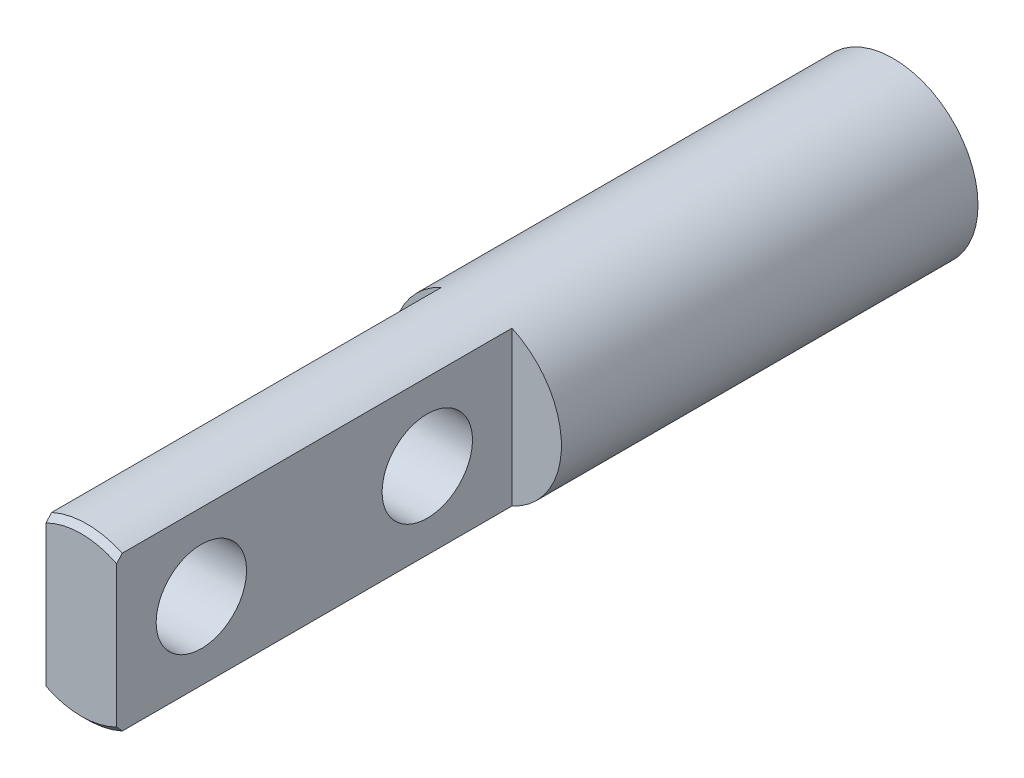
from build123d import *

# Parameters (mm, degrees)
SKETCH1_R           = 3
BOSS_EXTRUDE1_DEPTH = 14.75
BOSS_EXTRUDE2_DEPTH = 14
SKETCH3_R           = 1.6
CUT_EXTRUDE1_DEPTH  = 2.5
CHAMFER1_SIZE       = 0.2


with BuildPart() as part:
    # Sketch1 → Boss-Extrude1 (new body)
    with BuildSketch(Plane.XY):
        Circle(SKETCH1_R)
    extrude(amount=BOSS_EXTRUDE1_DEPTH)

    # Sketch2 → Boss-Extrude2 (add)
    with BuildSketch(Plane.XY.offset(14.75)):
        with BuildLine():
            Line((1.25, -2.727178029), (1.25, 2.727178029))
            ThreePointArc((1.25, 2.727178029), (0, 3), (-1.25, 2.727178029))
            Line((-1.25, 2.727178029), (-1.25, -2.727178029))
            ThreePointArc((-1.25, -2.727178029), (0, -3), (1.25, -2.727178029))
        make_face()
    extrude(amount=BOSS_EXTRUDE2_DEPTH)

    # Sketch3 → Cut-Extrude1 (cut)
    with BuildSketch(Plane.ZY.offset(1.25)):
        with Locations((25.75, 0)):
            Circle(SKETCH3_R)
        with Locations((17.75, 0)):
            Circle(SKETCH3_R)
    extrude(amount=-CUT_EXTRUDE1_DEPTH, mode=Mode.SUBTRACT)

    # Chamfer1
    chamfer1_edges = [part.edges().sort_by_distance(p)[0] for p in [
        (0, -3, 28.75),
        (0, 3, 28.75),
    ]]
    chamfer(chamfer1_edges, length=CHAMFER1_SIZE)


solid = part.part
